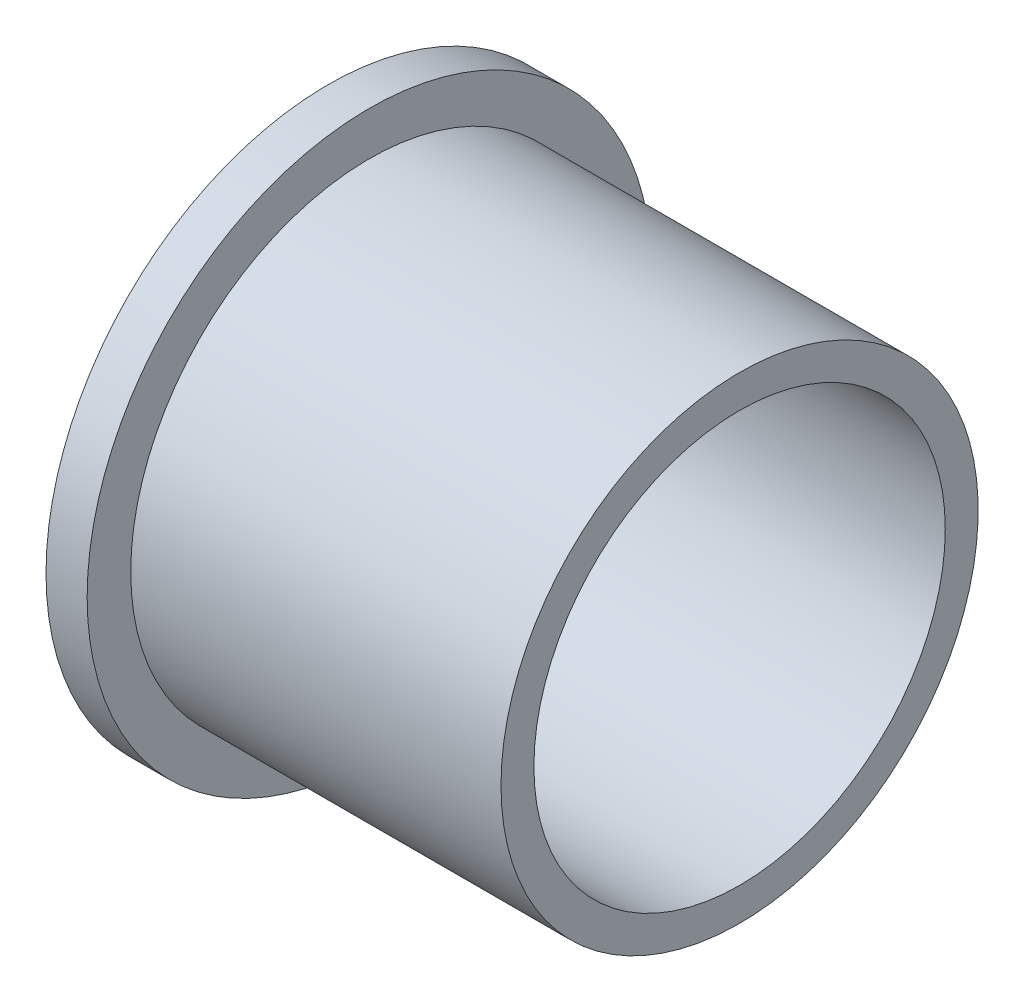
from build123d import *


with BuildPart() as part:
    # Esquisse1 → Base-R_volution (revolve)
    with BuildSketch(Plane.XY, mode=Mode.PRIVATE) as base_r_volution_sk:
        Polygon((0, -25), (0, -34.3), (5, -34.3), (5, -29), (50, -29), (50, -25), align=None)
    revolve(base_r_volution_sk.sketch.rotate(Axis((0, 0, 0), (1, 0, 0)), 270), axis=Axis((0, 0, 0), (1, 0, 0)))


solid = part.part
